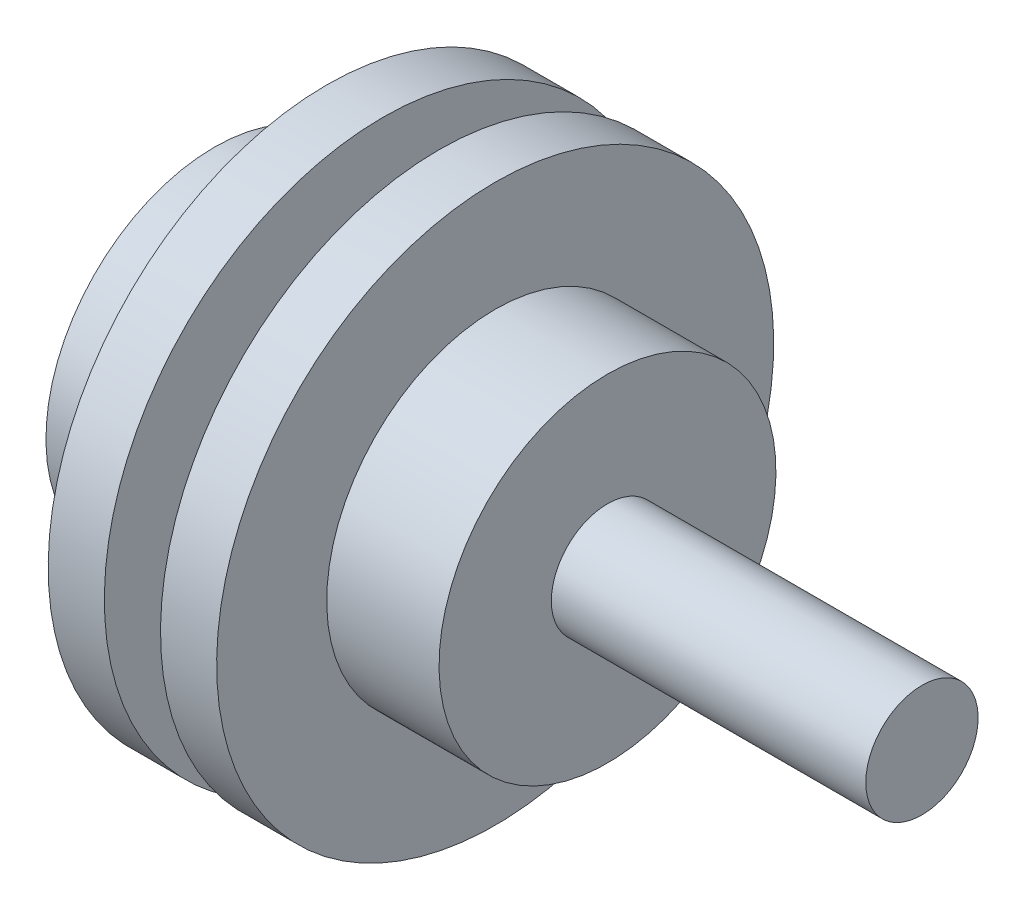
from build123d import *

# Parameters (mm, degrees)
SKETCH2_R           = 6.35
BOSS_EXTRUDE1_DEPTH = 35.56


with BuildPart() as part:
    # Sketch1 → Revolve1 (revolve)
    with BuildSketch(Plane.XY):
        Polygon((0, 0), (0, 12.446), (6.35, 12.446), (6.35, 0), (12.7, 0), (12.7, 12.446), (19.05, 12.446), (19.05, 0), (31.75, 0), (31.75, -19.05), (-12.7, -19.05), (-12.7, 0), align=None)
    revolve(axis=Axis((31.75, -19.05, 0), (-1, 0, 0)))

    # Sketch2 → Boss-Extrude1 (add)
    with BuildSketch(Plane(origin=(31.75, 0, 0), x_dir=(0, 0, -1), z_dir=(1, 0, 0))):
        with Locations(Location((0, -19.05, 0), (0, 0, 180))):
            Circle(SKETCH2_R)
    extrude(amount=BOSS_EXTRUDE1_DEPTH)


solid = part.part
